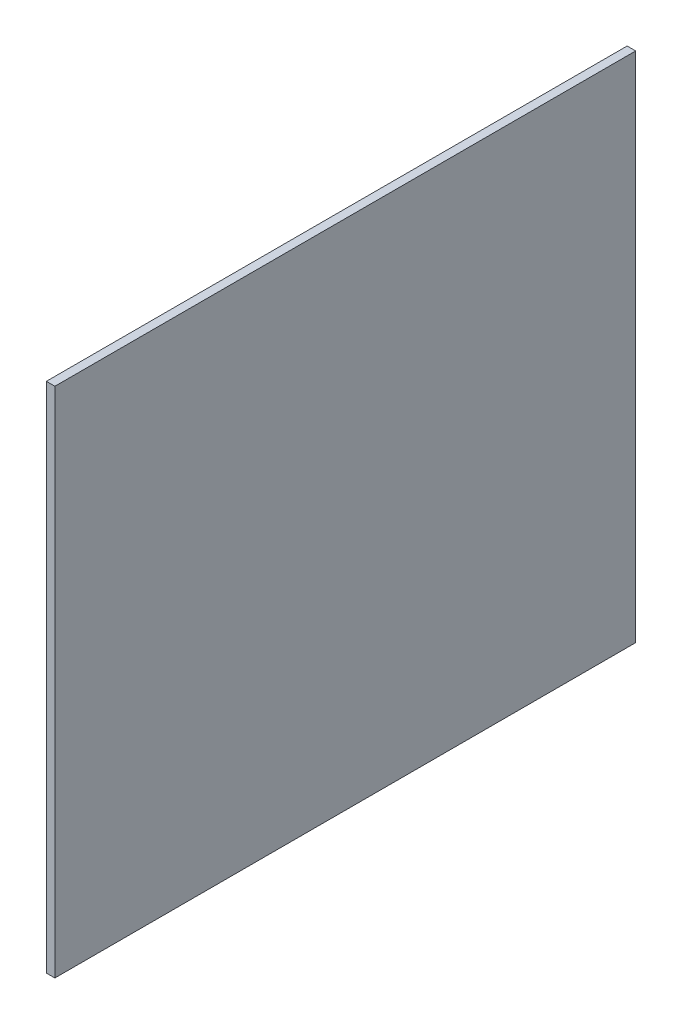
from build123d import *

# Parameters (mm, degrees)
SKETCH1_W      = 6.35
SKETCH1_H      = 381
EXTRUDE1_DEPTH = 215.9


with BuildPart() as part:
    # Sketch1 → Extrude1 (new, symmetric)
    with BuildSketch(Plane.XY):
        with Locations((3.175, 0)):
            Rectangle(SKETCH1_W, SKETCH1_H)
    extrude(amount=EXTRUDE1_DEPTH, both=True)


solid = part.part
